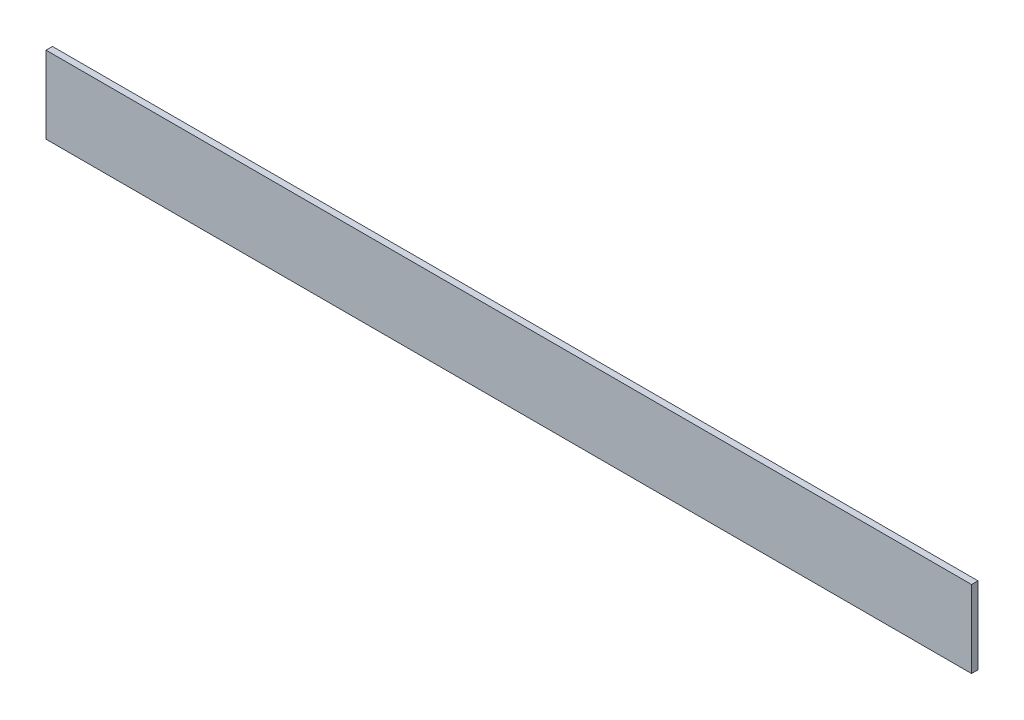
from build123d import *

# Parameters (mm, degrees)
SKETCH1_W           = 914.4
SKETCH1_H           = 76.2
BOSS_EXTRUDE1_DEPTH = 6.35


with BuildPart() as part:
    # Sketch1 → Boss-Extrude1 (new body)
    with BuildSketch(Plane.XY):
        Rectangle(SKETCH1_W, SKETCH1_H)
    extrude(amount=BOSS_EXTRUDE1_DEPTH)


solid = part.part
